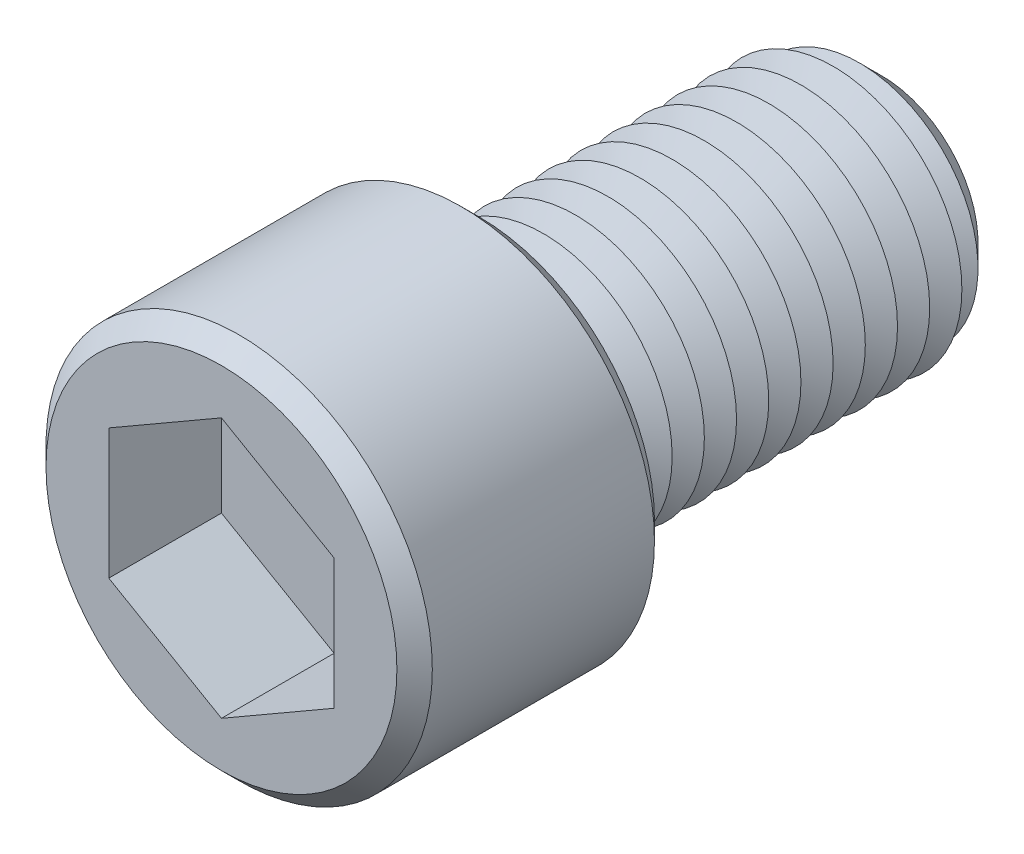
from build123d import *

# Parameters (mm, degrees)
SKETCH1_R           = 12
BOSS_EXTRUDE1_DEPTH = 16
SKETCH2_R           = 8
BOSS_EXTRUDE2_DEPTH = 25
CHAMFER1_SIZE       = 2
LPATTERN1_COUNT     = 12
LPATTERN1_PITCH     = 2
CUT_EXTRUDE1_DEPTH  = 7
SKETCH6_R           = 0.9
CUT_EXTRUDE2_DEPTH  = 34
CHAMFER2_SIZE       = 1.1


with BuildPart() as part:
    # Sketch1 → Boss-Extrude1 (new body)
    with BuildSketch(Plane.XY):
        Circle(SKETCH1_R)
    extrude(amount=BOSS_EXTRUDE1_DEPTH)

    # Sketch2 → Boss-Extrude2 (add)
    with BuildSketch(Plane(origin=(0, 0, 0), x_dir=(-1, 0, 0), z_dir=(0, 0, -1))):
        Circle(SKETCH2_R)
    extrude(amount=BOSS_EXTRUDE2_DEPTH)

    # Chamfer1
    chamfer1_edges = [part.edges().sort_by_distance(p)[0] for p in [
        (8, 0, -25),
    ]]
    chamfer(chamfer1_edges, length=CHAMFER1_SIZE)

    # Sketch4 → Cut-Revolve1 (revolve, cut)
    with BuildSketch(Plane(origin=(0, 0, 0), x_dir=(0, 0, -1), z_dir=(1, 0, 0)), mode=Mode.PRIVATE) as cut_revolve1_sk:
        Polygon((0, 8), (1, 6.267949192), (2, 8), align=None)
    cut_revolve1 = revolve(cut_revolve1_sk.sketch.rotate(Axis((0, 0, 2.512122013), (0, 0, -1)), 90), axis=Axis((0, 0, 2.512122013), (0, 0, -1)), mode=Mode.SUBTRACT)

    # LPattern1: Cut-Revolve1 ×12
    with Locations(*[(0, 0, -i * LPATTERN1_PITCH) for i in range(1, LPATTERN1_COUNT)]):
        add(cut_revolve1, mode=Mode.SUBTRACT)

    # Sketch5 → Cut-Extrude1 (cut)
    with BuildSketch(Plane.XY.offset(16)):
        Polygon((0, 8.082903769), (-7, 4.041451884), (-7, -4.041451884), (0, -8.082903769), (7, -4.041451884), (7, 4.041451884), align=None)
    extrude(amount=-CUT_EXTRUDE1_DEPTH, mode=Mode.SUBTRACT)

    # Sketch6 → Cut-Extrude2 (cut)
    with BuildSketch(Plane.XY.offset(9)):
        Circle(SKETCH6_R)
    extrude(amount=-CUT_EXTRUDE2_DEPTH, mode=Mode.SUBTRACT)

    # Chamfer2
    chamfer2_edges = [part.edges().sort_by_distance(p)[0] for p in [
        (-12, 0, 0),
        (-12, 0, 16),
    ]]
    chamfer(chamfer2_edges, length=CHAMFER2_SIZE)


solid = part.part
